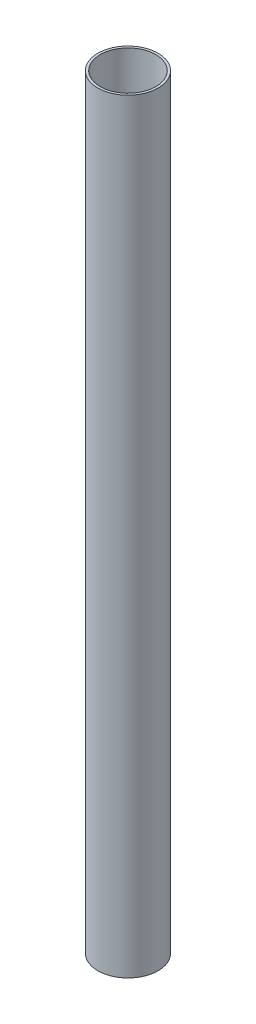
from build123d import *

# Parameters (mm, degrees)
SKETCH1_R           = 13
SKETCH1_R_2         = 12
BOSS_EXTRUDE1_DEPTH = 330


with BuildPart() as part:
    # Sketch1 → Boss-Extrude1 (new body)
    with BuildSketch(Plane(origin=(0, 0, 0), x_dir=(1, 0, 0), z_dir=(0, 1, 0))):
        with Locations(Location((0, 0, 0), (0, 0, 270))):
            Circle(SKETCH1_R)
        with Locations(Location((0, 0, 0), (0, 0, 270))):
            Circle(SKETCH1_R_2, mode=Mode.SUBTRACT)
    extrude(amount=-BOSS_EXTRUDE1_DEPTH)


solid = part.part
